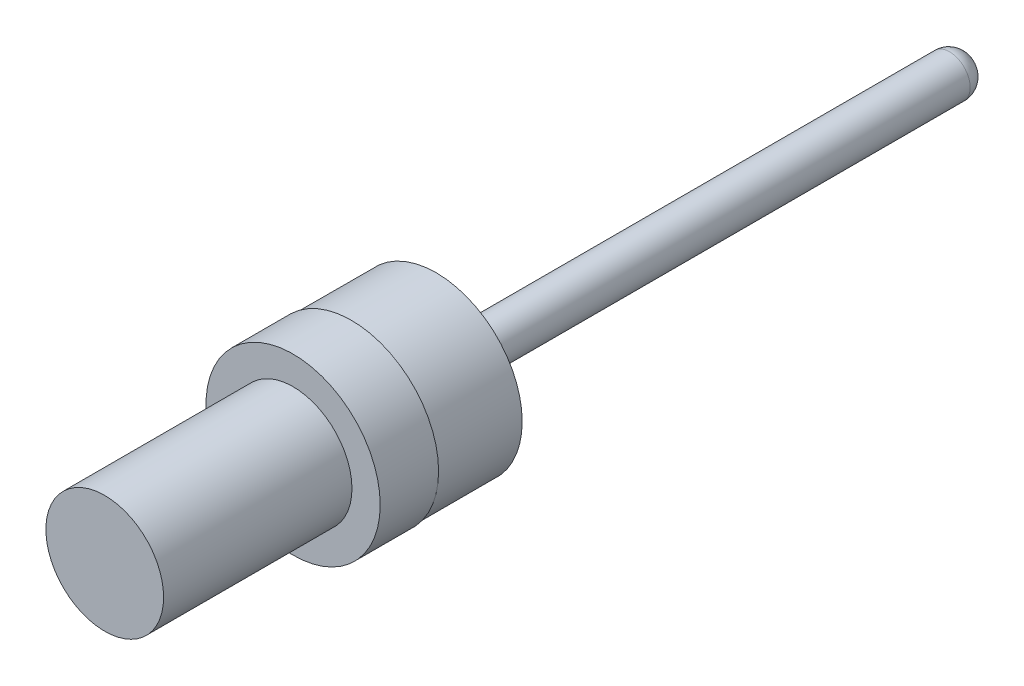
ISO-10303-21;
HEADER;
FILE_DESCRIPTION(('STEP AP214'),'2;1');
FILE_NAME('part.step','',(''),(''),'','','');
FILE_SCHEMA(('AUTOMOTIVE_DESIGN { 1 0 10303 214 1 1 1 1 }'));
ENDSEC;
DATA;
#1=APPLICATION_CONTEXT('core data for automotive mechanical design processes');
#2=APPLICATION_PROTOCOL_DEFINITION('international standard','automotive_design',2000,#1);
#3=PRODUCT_CONTEXT('',#1,'mechanical');
#4=PRODUCT('Part','Part','',(#3));
#5=PRODUCT_RELATED_PRODUCT_CATEGORY('part','',(#4));
#6=PRODUCT_DEFINITION_FORMATION('','',#4);
#7=PRODUCT_DEFINITION_CONTEXT('part definition',#1,'design');
#8=PRODUCT_DEFINITION('design','',#6,#7);
#9=PRODUCT_DEFINITION_SHAPE('','',#8);
#10=(LENGTH_UNIT() NAMED_UNIT(*) SI_UNIT(.MILLI.,.METRE.));
#11=(NAMED_UNIT(*) PLANE_ANGLE_UNIT() SI_UNIT($,.RADIAN.));
#12=(NAMED_UNIT(*) SI_UNIT($,.STERADIAN.) SOLID_ANGLE_UNIT());
#13=UNCERTAINTY_MEASURE_WITH_UNIT(LENGTH_MEASURE(1.E-05),#10,'distance_accuracy_value','');
#14=(GEOMETRIC_REPRESENTATION_CONTEXT(3) GLOBAL_UNCERTAINTY_ASSIGNED_CONTEXT((#13)) GLOBAL_UNIT_ASSIGNED_CONTEXT((#10,
#11,#12)) REPRESENTATION_CONTEXT('',''));
#15=CARTESIAN_POINT('',(0.,0.,0.));
#16=DIRECTION('',(0.,0.,1.));
#17=DIRECTION('',(1.,0.,0.));
#18=AXIS2_PLACEMENT_3D('',#15,#16,#17);
#19=CARTESIAN_POINT('',(0.,0.,3.1496));
#20=DIRECTION('',(0.,0.,1.));
#21=DIRECTION('',(1.,0.,0.));
#22=AXIS2_PLACEMENT_3D('',#19,#20,#21);
#23=PLANE('',#22);
#24=CARTESIAN_POINT('',(0.,0.,3.1496));
#25=DIRECTION('',(0.,0.,1.));
#26=DIRECTION('',(1.,0.,0.));
#27=AXIS2_PLACEMENT_3D('',#24,#25,#26);
#28=CIRCLE('',#27,4.699);
#29=CARTESIAN_POINT('',(4.699,0.,3.1496));
#30=VERTEX_POINT('',#29);
#31=EDGE_CURVE('E43',#30,#30,#28,.T.);
#32=ORIENTED_EDGE('',*,*,#31,.T.);
#33=EDGE_LOOP('',(#32));
#34=FACE_BOUND('',#33,.T.);
#35=CARTESIAN_POINT('',(0.,0.,3.1496));
#36=DIRECTION('',(0.,0.,1.));
#37=DIRECTION('',(1.,0.,0.));
#38=AXIS2_PLACEMENT_3D('',#35,#36,#37);
#39=CIRCLE('',#38,3.175);
#40=CARTESIAN_POINT('',(3.175,0.,3.1496));
#41=VERTEX_POINT('',#40);
#42=EDGE_CURVE('E60',#41,#41,#39,.T.);
#43=ORIENTED_EDGE('',*,*,#42,.F.);
#44=EDGE_LOOP('',(#43));
#45=FACE_BOUND('',#44,.T.);
#46=ADVANCED_FACE('F28',(#34,#45),#23,.T.);
#47=CARTESIAN_POINT('',(0.,0.,-4.572));
#48=DIRECTION('',(0.,0.,-1.));
#49=DIRECTION('',(-1.,0.,0.));
#50=AXIS2_PLACEMENT_3D('',#47,#48,#49);
#51=PLANE('',#50);
#52=CARTESIAN_POINT('',(0.,0.,-4.572));
#53=DIRECTION('',(0.,0.,-1.));
#54=DIRECTION('',(-1.,0.,0.));
#55=AXIS2_PLACEMENT_3D('',#52,#53,#54);
#56=CIRCLE('',#55,4.6355);
#57=CARTESIAN_POINT('',(-4.6355,0.,-4.572));
#58=VERTEX_POINT('',#57);
#59=EDGE_CURVE('E51',#58,#58,#56,.T.);
#60=ORIENTED_EDGE('',*,*,#59,.T.);
#61=EDGE_LOOP('',(#60));
#62=FACE_BOUND('',#61,.T.);
#63=CARTESIAN_POINT('',(0.,0.,-4.572));
#64=DIRECTION('',(0.,0.,-1.));
#65=DIRECTION('',(-1.,0.,0.));
#66=AXIS2_PLACEMENT_3D('',#63,#64,#65);
#67=CIRCLE('',#66,1.1176);
#68=CARTESIAN_POINT('',(1.1176,0.,-4.572));
#69=VERTEX_POINT('',#68);
#70=EDGE_CURVE('E54',#69,#69,#67,.T.);
#71=ORIENTED_EDGE('',*,*,#70,.F.);
#72=EDGE_LOOP('',(#71));
#73=FACE_BOUND('',#72,.T.);
#74=ADVANCED_FACE('F67',(#62,#73),#51,.T.);
#75=CARTESIAN_POINT('',(0.,0.,0.));
#76=DIRECTION('',(0.,0.,1.));
#77=DIRECTION('',(1.,0.,0.));
#78=AXIS2_PLACEMENT_3D('',#75,#76,#77);
#79=PLANE('',#78);
#80=CARTESIAN_POINT('',(0.,0.,0.));
#81=DIRECTION('',(0.,0.,1.));
#82=DIRECTION('',(1.,0.,0.));
#83=AXIS2_PLACEMENT_3D('',#80,#81,#82);
#84=CIRCLE('',#83,4.699);
#85=CARTESIAN_POINT('',(4.699,0.,0.));
#86=VERTEX_POINT('',#85);
#87=EDGE_CURVE('E48',#86,#86,#84,.T.);
#88=ORIENTED_EDGE('',*,*,#87,.F.);
#89=EDGE_LOOP('',(#88));
#90=FACE_BOUND('',#89,.T.);
#91=CARTESIAN_POINT('',(0.,0.,0.));
#92=DIRECTION('',(0.,0.,1.));
#93=DIRECTION('',(1.,0.,0.));
#94=AXIS2_PLACEMENT_3D('',#91,#92,#93);
#95=CIRCLE('',#94,4.6355);
#96=CARTESIAN_POINT('',(4.6355,0.,0.));
#97=VERTEX_POINT('',#96);
#98=EDGE_CURVE('E39',#97,#97,#95,.F.);
#99=ORIENTED_EDGE('',*,*,#98,.F.);
#100=EDGE_LOOP('',(#99));
#101=FACE_BOUND('',#100,.T.);
#102=ADVANCED_FACE('F72',(#90,#101),#79,.F.);
#103=CARTESIAN_POINT('',(0.,0.,3.1496));
#104=DIRECTION('',(0.,0.,-1.));
#105=DIRECTION('',(-1.,0.,0.));
#106=AXIS2_PLACEMENT_3D('',#103,#104,#105);
#107=CYLINDRICAL_SURFACE('',#106,4.699);
#108=ORIENTED_EDGE('',*,*,#31,.F.);
#109=EDGE_LOOP('',(#108));
#110=FACE_BOUND('',#109,.T.);
#111=ORIENTED_EDGE('',*,*,#87,.T.);
#112=EDGE_LOOP('',(#111));
#113=FACE_BOUND('',#112,.T.);
#114=ADVANCED_FACE('F30',(#110,#113),#107,.T.);
#115=CARTESIAN_POINT('',(0.,0.,-4.572));
#116=DIRECTION('',(0.,0.,1.));
#117=DIRECTION('',(1.,0.,0.));
#118=AXIS2_PLACEMENT_3D('',#115,#116,#117);
#119=CYLINDRICAL_SURFACE('',#118,4.6355);
#120=ORIENTED_EDGE('',*,*,#59,.F.);
#121=EDGE_LOOP('',(#120));
#122=FACE_BOUND('',#121,.T.);
#123=ORIENTED_EDGE('',*,*,#98,.T.);
#124=EDGE_LOOP('',(#123));
#125=FACE_BOUND('',#124,.T.);
#126=ADVANCED_FACE('F79',(#122,#125),#119,.T.);
#127=CARTESIAN_POINT('',(0.,0.,-33.274));
#128=DIRECTION('',(0.,0.,1.));
#129=DIRECTION('',(1.,0.,0.));
#130=AXIS2_PLACEMENT_3D('',#127,#128,#129);
#131=CYLINDRICAL_SURFACE('',#130,1.1176);
#132=CARTESIAN_POINT('',(0.,0.,-32.258));
#133=DIRECTION('',(0.,0.,-1.));
#134=DIRECTION('',(-1.,0.,0.));
#135=AXIS2_PLACEMENT_3D('',#132,#133,#134);
#136=CIRCLE('',#135,1.1176);
#137=CARTESIAN_POINT('',(1.1176,0.,-32.258));
#138=VERTEX_POINT('',#137);
#139=EDGE_CURVE('E10',#138,#138,#136,.F.);
#140=CARTESIAN_POINT('',(1.1176,0.,-32.258));
#141=CARTESIAN_POINT('',(1.1176,0.,-31.9696041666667));
#142=CARTESIAN_POINT('',(1.1176,0.,-31.6812083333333));
#143=CARTESIAN_POINT('',(1.1176,0.,-31.1044166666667));
#144=CARTESIAN_POINT('',(1.1176,0.,-30.8160208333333));
#145=CARTESIAN_POINT('',(1.1176,0.,-30.2392291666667));
#146=CARTESIAN_POINT('',(1.1176,0.,-29.9508333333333));
#147=CARTESIAN_POINT('',(1.1176,0.,-29.3740416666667));
#148=CARTESIAN_POINT('',(1.1176,0.,-29.0856458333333));
#149=CARTESIAN_POINT('',(1.1176,0.,-28.5088541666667));
#150=CARTESIAN_POINT('',(1.1176,0.,-28.2204583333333));
#151=CARTESIAN_POINT('',(1.1176,0.,-27.6436666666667));
#152=CARTESIAN_POINT('',(1.1176,0.,-27.3552708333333));
#153=CARTESIAN_POINT('',(1.1176,0.,-26.7784791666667));
#154=CARTESIAN_POINT('',(1.1176,0.,-26.4900833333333));
#155=CARTESIAN_POINT('',(1.1176,0.,-25.9132916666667));
#156=CARTESIAN_POINT('',(1.1176,0.,-25.6248958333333));
#157=CARTESIAN_POINT('',(1.1176,0.,-25.0481041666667));
#158=CARTESIAN_POINT('',(1.1176,0.,-24.7597083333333));
#159=CARTESIAN_POINT('',(1.1176,0.,-24.1829166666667));
#160=CARTESIAN_POINT('',(1.1176,0.,-23.8945208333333));
#161=CARTESIAN_POINT('',(1.1176,0.,-23.3177291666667));
#162=CARTESIAN_POINT('',(1.1176,0.,-23.0293333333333));
#163=CARTESIAN_POINT('',(1.1176,0.,-22.4525416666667));
#164=CARTESIAN_POINT('',(1.1176,0.,-22.1641458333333));
#165=CARTESIAN_POINT('',(1.1176,0.,-21.5873541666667));
#166=CARTESIAN_POINT('',(1.1176,0.,-21.2989583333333));
#167=CARTESIAN_POINT('',(1.1176,0.,-20.7221666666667));
#168=CARTESIAN_POINT('',(1.1176,0.,-20.4337708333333));
#169=CARTESIAN_POINT('',(1.1176,0.,-19.8569791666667));
#170=CARTESIAN_POINT('',(1.1176,0.,-19.5685833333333));
#171=CARTESIAN_POINT('',(1.1176,0.,-18.9917916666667));
#172=CARTESIAN_POINT('',(1.1176,0.,-18.7033958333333));
#173=CARTESIAN_POINT('',(1.1176,0.,-18.1266041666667));
#174=CARTESIAN_POINT('',(1.1176,0.,-17.8382083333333));
#175=CARTESIAN_POINT('',(1.1176,0.,-17.2614166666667));
#176=CARTESIAN_POINT('',(1.1176,0.,-16.9730208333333));
#177=CARTESIAN_POINT('',(1.1176,0.,-16.3962291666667));
#178=CARTESIAN_POINT('',(1.1176,0.,-16.1078333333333));
#179=CARTESIAN_POINT('',(1.1176,0.,-15.5310416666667));
#180=CARTESIAN_POINT('',(1.1176,0.,-15.2426458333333));
#181=CARTESIAN_POINT('',(1.1176,0.,-14.6658541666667));
#182=CARTESIAN_POINT('',(1.1176,0.,-14.3774583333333));
#183=CARTESIAN_POINT('',(1.1176,0.,-13.8006666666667));
#184=CARTESIAN_POINT('',(1.1176,0.,-13.5122708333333));
#185=CARTESIAN_POINT('',(1.1176,0.,-12.9354791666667));
#186=CARTESIAN_POINT('',(1.1176,0.,-12.6470833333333));
#187=CARTESIAN_POINT('',(1.1176,0.,-12.0702916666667));
#188=CARTESIAN_POINT('',(1.1176,0.,-11.7818958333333));
#189=CARTESIAN_POINT('',(1.1176,0.,-11.2051041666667));
#190=CARTESIAN_POINT('',(1.1176,0.,-10.9167083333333));
#191=CARTESIAN_POINT('',(1.1176,0.,-10.3399166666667));
#192=CARTESIAN_POINT('',(1.1176,0.,-10.0515208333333));
#193=CARTESIAN_POINT('',(1.1176,0.,-9.47472916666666));
#194=CARTESIAN_POINT('',(1.1176,0.,-9.18633333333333));
#195=CARTESIAN_POINT('',(1.1176,0.,-8.60954166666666));
#196=CARTESIAN_POINT('',(1.1176,0.,-8.32114583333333));
#197=CARTESIAN_POINT('',(1.1176,0.,-7.74435416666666));
#198=CARTESIAN_POINT('',(1.1176,0.,-7.45595833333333));
#199=CARTESIAN_POINT('',(1.1176,0.,-6.87916666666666));
#200=CARTESIAN_POINT('',(1.1176,0.,-6.59077083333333));
#201=CARTESIAN_POINT('',(1.1176,0.,-6.01397916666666));
#202=CARTESIAN_POINT('',(1.1176,0.,-5.72558333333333));
#203=CARTESIAN_POINT('',(1.1176,0.,-5.14879166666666));
#204=CARTESIAN_POINT('',(1.1176,0.,-4.86039583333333));
#205=CARTESIAN_POINT('',(1.1176,0.,-4.572));
#206=B_SPLINE_CURVE_WITH_KNOTS('',3,(#140,#141,#142,#143,#144,#145,#146,#147,#148,#149,#150,
#151,#152,#153,#154,#155,#156,#157,#158,#159,#160,#161,#162,#163,#164,#165,#166,#167,#168,#169,
#170,#171,#172,#173,#174,#175,#176,#177,#178,#179,#180,#181,#182,#183,#184,#185,#186,#187,#188,
#189,#190,#191,#192,#193,#194,#195,#196,#197,#198,#199,#200,#201,#202,#203,#204,#205),
.UNSPECIFIED.,.F.,.F.,(4,2,2,2,2,2,2,2,2,2,2,2,2,2,2,2,2,2,2,2,2,2,2,2,2,2,2,2,2,2,2,2,4),(0.,
0.865187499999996,1.730375,2.5955625,3.46075,4.32593749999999,5.19112499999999,6.0563125,6.9215,
7.78668749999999,8.651875,9.51706249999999,10.38225,11.2474375,12.112625,12.9778125,13.843,
14.7081875,15.573375,16.4385625,17.30375,18.1689375,19.034125,19.8993125,20.7645,21.6296875,
22.494875,23.3600625,24.22525,25.0904375,25.955625,26.8208125,27.686),.UNSPECIFIED.);
#207=EDGE_CURVE('BSEAM81',#138,#69,#206,.T.);
#208=ORIENTED_EDGE('',*,*,#139,.T.);
#209=ORIENTED_EDGE('',*,*,#70,.T.);
#210=ORIENTED_EDGE('',*,*,#207,.T.);
#211=ORIENTED_EDGE('',*,*,#207,.F.);
#212=EDGE_LOOP('',(#208,#210,#209,#211));
#213=FACE_BOUND('',#212,.T.);
#214=ADVANCED_FACE('F81',(#213),#131,.T.);
#215=CARTESIAN_POINT('',(0.,0.,-33.274));
#216=DIRECTION('',(0.,0.,-1.));
#217=DIRECTION('',(-1.,0.,0.));
#218=AXIS2_PLACEMENT_3D('',#215,#216,#217);
#219=PLANE('',#218);
#220=CARTESIAN_POINT('',(0.,0.,-33.274));
#221=DIRECTION('',(0.,0.,-1.));
#222=DIRECTION('',(-1.,0.,0.));
#223=AXIS2_PLACEMENT_3D('',#220,#221,#222);
#224=CIRCLE('',#223,0.1016);
#225=CARTESIAN_POINT('',(-0.1016,0.,-33.274));
#226=VERTEX_POINT('',#225);
#227=EDGE_CURVE('E35',#226,#226,#224,.T.);
#228=ORIENTED_EDGE('',*,*,#227,.T.);
#229=EDGE_LOOP('',(#228));
#230=FACE_BOUND('',#229,.T.);
#231=ADVANCED_FACE('F86',(#230),#219,.T.);
#232=CARTESIAN_POINT('',(0.,0.,-32.258));
#233=DIRECTION('',(0.,0.,-1.));
#234=DIRECTION('',(-1.,0.,0.));
#235=AXIS2_PLACEMENT_3D('',#232,#233,#234);
#236=DEGENERATE_TOROIDAL_SURFACE('',#235,0.1016,1.016,.T.);
#237=ORIENTED_EDGE('',*,*,#139,.F.);
#238=EDGE_LOOP('',(#237));
#239=FACE_BOUND('',#238,.T.);
#240=ORIENTED_EDGE('',*,*,#227,.F.);
#241=EDGE_LOOP('',(#240));
#242=FACE_BOUND('',#241,.T.);
#243=ADVANCED_FACE('F89',(#239,#242),#236,.T.);
#244=CARTESIAN_POINT('',(0.,0.,13.3096));
#245=DIRECTION('',(0.,0.,-1.));
#246=DIRECTION('',(-1.,0.,0.));
#247=AXIS2_PLACEMENT_3D('',#244,#245,#246);
#248=CYLINDRICAL_SURFACE('',#247,3.175);
#249=CARTESIAN_POINT('',(0.,0.,13.3096));
#250=DIRECTION('',(0.,0.,1.));
#251=DIRECTION('',(1.,0.,0.));
#252=AXIS2_PLACEMENT_3D('',#249,#250,#251);
#253=CIRCLE('',#252,3.175);
#254=CARTESIAN_POINT('',(3.175,0.,13.3096));
#255=VERTEX_POINT('',#254);
#256=EDGE_CURVE('E57',#255,#255,#253,.T.);
#257=ORIENTED_EDGE('',*,*,#256,.F.);
#258=EDGE_LOOP('',(#257));
#259=FACE_BOUND('',#258,.T.);
#260=ORIENTED_EDGE('',*,*,#42,.T.);
#261=EDGE_LOOP('',(#260));
#262=FACE_BOUND('',#261,.T.);
#263=ADVANCED_FACE('F64',(#259,#262),#248,.T.);
#264=CARTESIAN_POINT('',(0.,0.,13.3096));
#265=DIRECTION('',(0.,0.,1.));
#266=DIRECTION('',(1.,0.,0.));
#267=AXIS2_PLACEMENT_3D('',#264,#265,#266);
#268=PLANE('',#267);
#269=ORIENTED_EDGE('',*,*,#256,.T.);
#270=EDGE_LOOP('',(#269));
#271=FACE_BOUND('',#270,.T.);
#272=ADVANCED_FACE('F95',(#271),#268,.T.);
#273=CLOSED_SHELL('',(#46,#74,#102,#114,#126,#214,#231,#243,#263,#272));
#274=MANIFOLD_SOLID_BREP('B2',#273);
#275=ADVANCED_BREP_SHAPE_REPRESENTATION('',(#18,#274),#14);
#276=SHAPE_DEFINITION_REPRESENTATION(#9,#275);
ENDSEC;
END-ISO-10303-21;
